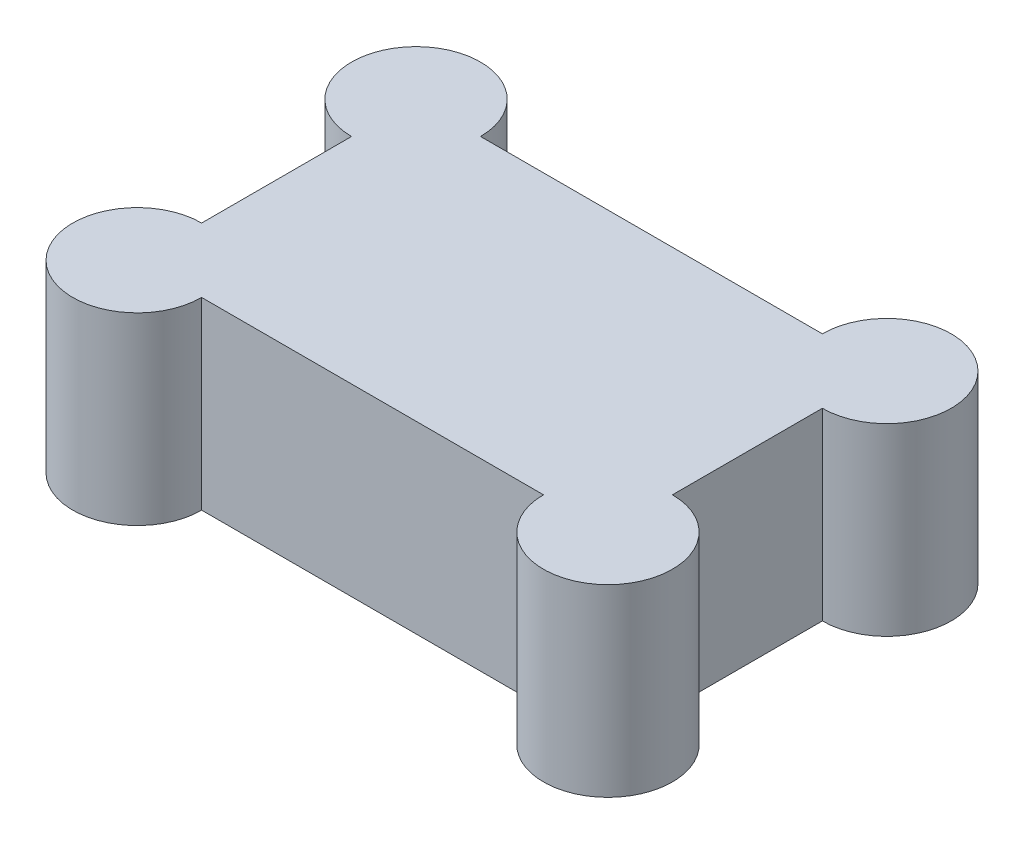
ISO-10303-21;
HEADER;
FILE_DESCRIPTION(('STEP AP214'),'2;1');
FILE_NAME('part.step','',(''),(''),'','','');
FILE_SCHEMA(('AUTOMOTIVE_DESIGN { 1 0 10303 214 1 1 1 1 }'));
ENDSEC;
DATA;
#1=APPLICATION_CONTEXT('core data for automotive mechanical design processes');
#2=APPLICATION_PROTOCOL_DEFINITION('international standard','automotive_design',2000,#1);
#3=PRODUCT_CONTEXT('',#1,'mechanical');
#4=PRODUCT('Part','Part','',(#3));
#5=PRODUCT_RELATED_PRODUCT_CATEGORY('part','',(#4));
#6=PRODUCT_DEFINITION_FORMATION('','',#4);
#7=PRODUCT_DEFINITION_CONTEXT('part definition',#1,'design');
#8=PRODUCT_DEFINITION('design','',#6,#7);
#9=PRODUCT_DEFINITION_SHAPE('','',#8);
#10=(LENGTH_UNIT() NAMED_UNIT(*) SI_UNIT(.MILLI.,.METRE.));
#11=(NAMED_UNIT(*) PLANE_ANGLE_UNIT() SI_UNIT($,.RADIAN.));
#12=(NAMED_UNIT(*) SI_UNIT($,.STERADIAN.) SOLID_ANGLE_UNIT());
#13=UNCERTAINTY_MEASURE_WITH_UNIT(LENGTH_MEASURE(1.E-05),#10,'distance_accuracy_value','');
#14=(GEOMETRIC_REPRESENTATION_CONTEXT(3) GLOBAL_UNCERTAINTY_ASSIGNED_CONTEXT((#13)) GLOBAL_UNIT_ASSIGNED_CONTEXT((#10,
#11,#12)) REPRESENTATION_CONTEXT('',''));
#15=CARTESIAN_POINT('',(0.,0.,0.));
#16=DIRECTION('',(0.,0.,1.));
#17=DIRECTION('',(1.,0.,0.));
#18=AXIS2_PLACEMENT_3D('',#15,#16,#17);
#19=CARTESIAN_POINT('',(-25.5535213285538,20.,-15.1362990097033));
#20=DIRECTION('',(0.,-1.,0.));
#21=DIRECTION('',(0.,0.,-1.));
#22=AXIS2_PLACEMENT_3D('',#19,#20,#21);
#23=CYLINDRICAL_SURFACE('',#22,7.);
#24=CARTESIAN_POINT('',(-25.5535213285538,0.,-15.1362990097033));
#25=DIRECTION('',(0.,1.,0.));
#26=DIRECTION('',(0.,0.,1.));
#27=AXIS2_PLACEMENT_3D('',#24,#25,#26);
#28=CIRCLE('',#27,7.);
#29=CARTESIAN_POINT('',(-18.5535213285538,0.,-15.1362990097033));
#30=VERTEX_POINT('',#29);
#31=CARTESIAN_POINT('',(-25.5535213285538,0.,-8.13629900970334));
#32=VERTEX_POINT('',#31);
#33=EDGE_CURVE('E131',#30,#32,#28,.T.);
#34=ORIENTED_EDGE('',*,*,#33,.T.);
#35=DIRECTION('',(0.,-1.,0.));
#36=VECTOR('',#35,1.);
#37=CARTESIAN_POINT('',(-25.5535213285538,20.,-8.13629900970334));
#38=LINE('',#37,#36);
#39=CARTESIAN_POINT('',(-25.5535213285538,20.,-8.13629900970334));
#40=VERTEX_POINT('',#39);
#41=EDGE_CURVE('E11',#40,#32,#38,.T.);
#42=ORIENTED_EDGE('',*,*,#41,.F.);
#43=CARTESIAN_POINT('',(-25.5535213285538,20.,-15.1362990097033));
#44=DIRECTION('',(0.,1.,0.));
#45=DIRECTION('',(0.,0.,1.));
#46=AXIS2_PLACEMENT_3D('',#43,#44,#45);
#47=CIRCLE('',#46,7.);
#48=CARTESIAN_POINT('',(-18.5535213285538,20.,-15.1362990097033));
#49=VERTEX_POINT('',#48);
#50=EDGE_CURVE('E148',#49,#40,#47,.T.);
#51=ORIENTED_EDGE('',*,*,#50,.F.);
#52=DIRECTION('',(0.,-1.,0.));
#53=VECTOR('',#52,1.);
#54=CARTESIAN_POINT('',(-18.5535213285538,20.,-15.1362990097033));
#55=LINE('',#54,#53);
#56=EDGE_CURVE('E49',#49,#30,#55,.T.);
#57=ORIENTED_EDGE('',*,*,#56,.T.);
#58=EDGE_LOOP('',(#34,#42,#51,#57));
#59=FACE_BOUND('',#58,.T.);
#60=ADVANCED_FACE('F33',(#59),#23,.T.);
#61=CARTESIAN_POINT('',(-25.5535213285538,20.,-8.13629900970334));
#62=DIRECTION('',(1.,0.,0.));
#63=DIRECTION('',(0.,0.,-1.));
#64=AXIS2_PLACEMENT_3D('',#61,#62,#63);
#65=PLANE('',#64);
#66=DIRECTION('',(0.,0.,1.));
#67=VECTOR('',#66,1.);
#68=CARTESIAN_POINT('',(-25.5535213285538,0.,-8.13629900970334));
#69=LINE('',#68,#67);
#70=CARTESIAN_POINT('',(-25.5535213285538,0.,8.13629900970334));
#71=VERTEX_POINT('',#70);
#72=EDGE_CURVE('E133',#32,#71,#69,.T.);
#73=ORIENTED_EDGE('',*,*,#72,.T.);
#74=DIRECTION('',(0.,-1.,0.));
#75=VECTOR('',#74,1.);
#76=CARTESIAN_POINT('',(-25.5535213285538,20.,8.13629900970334));
#77=LINE('',#76,#75);
#78=CARTESIAN_POINT('',(-25.5535213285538,20.,8.13629900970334));
#79=VERTEX_POINT('',#78);
#80=EDGE_CURVE('E41',#79,#71,#77,.T.);
#81=ORIENTED_EDGE('',*,*,#80,.F.);
#82=DIRECTION('',(0.,0.,1.));
#83=VECTOR('',#82,1.);
#84=CARTESIAN_POINT('',(-25.5535213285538,20.,-8.13629900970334));
#85=LINE('',#84,#83);
#86=EDGE_CURVE('E88',#40,#79,#85,.T.);
#87=ORIENTED_EDGE('',*,*,#86,.F.);
#88=ORIENTED_EDGE('',*,*,#41,.T.);
#89=EDGE_LOOP('',(#73,#81,#87,#88));
#90=FACE_BOUND('',#89,.T.);
#91=ADVANCED_FACE('F185',(#90),#65,.F.);
#92=CARTESIAN_POINT('',(-25.5535213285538,20.,15.1362990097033));
#93=DIRECTION('',(0.,-1.,0.));
#94=DIRECTION('',(0.,0.,-1.));
#95=AXIS2_PLACEMENT_3D('',#92,#93,#94);
#96=CYLINDRICAL_SURFACE('',#95,7.);
#97=CARTESIAN_POINT('',(-25.5535213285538,0.,15.1362990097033));
#98=DIRECTION('',(0.,1.,0.));
#99=DIRECTION('',(0.,0.,1.));
#100=AXIS2_PLACEMENT_3D('',#97,#98,#99);
#101=CIRCLE('',#100,7.);
#102=CARTESIAN_POINT('',(-18.5535213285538,0.,15.1362990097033));
#103=VERTEX_POINT('',#102);
#104=EDGE_CURVE('E135',#71,#103,#101,.T.);
#105=ORIENTED_EDGE('',*,*,#104,.T.);
#106=DIRECTION('',(0.,-1.,0.));
#107=VECTOR('',#106,1.);
#108=CARTESIAN_POINT('',(-18.5535213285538,20.,15.1362990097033));
#109=LINE('',#108,#107);
#110=CARTESIAN_POINT('',(-18.5535213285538,20.,15.1362990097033));
#111=VERTEX_POINT('',#110);
#112=EDGE_CURVE('E155',#111,#103,#109,.T.);
#113=ORIENTED_EDGE('',*,*,#112,.F.);
#114=CARTESIAN_POINT('',(-25.5535213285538,20.,15.1362990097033));
#115=DIRECTION('',(0.,1.,0.));
#116=DIRECTION('',(0.,0.,1.));
#117=AXIS2_PLACEMENT_3D('',#114,#115,#116);
#118=CIRCLE('',#117,7.);
#119=EDGE_CURVE('E163',#79,#111,#118,.T.);
#120=ORIENTED_EDGE('',*,*,#119,.F.);
#121=ORIENTED_EDGE('',*,*,#80,.T.);
#122=EDGE_LOOP('',(#105,#113,#120,#121));
#123=FACE_BOUND('',#122,.T.);
#124=ADVANCED_FACE('F161',(#123),#96,.T.);
#125=CARTESIAN_POINT('',(-18.5535213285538,20.,15.1362990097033));
#126=DIRECTION('',(0.,0.,-1.));
#127=DIRECTION('',(-1.,0.,0.));
#128=AXIS2_PLACEMENT_3D('',#125,#126,#127);
#129=PLANE('',#128);
#130=DIRECTION('',(1.,0.,0.));
#131=VECTOR('',#130,1.);
#132=CARTESIAN_POINT('',(-18.5535213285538,0.,15.1362990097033));
#133=LINE('',#132,#131);
#134=CARTESIAN_POINT('',(18.5535213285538,0.,15.1362990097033));
#135=VERTEX_POINT('',#134);
#136=EDGE_CURVE('E137',#103,#135,#133,.T.);
#137=ORIENTED_EDGE('',*,*,#136,.T.);
#138=DIRECTION('',(0.,-1.,0.));
#139=VECTOR('',#138,1.);
#140=CARTESIAN_POINT('',(18.5535213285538,20.,15.1362990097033));
#141=LINE('',#140,#139);
#142=CARTESIAN_POINT('',(18.5535213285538,20.,15.1362990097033));
#143=VERTEX_POINT('',#142);
#144=EDGE_CURVE('E152',#143,#135,#141,.T.);
#145=ORIENTED_EDGE('',*,*,#144,.F.);
#146=DIRECTION('',(1.,0.,0.));
#147=VECTOR('',#146,1.);
#148=CARTESIAN_POINT('',(-18.5535213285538,20.,15.1362990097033));
#149=LINE('',#148,#147);
#150=EDGE_CURVE('E126',#111,#143,#149,.T.);
#151=ORIENTED_EDGE('',*,*,#150,.F.);
#152=ORIENTED_EDGE('',*,*,#112,.T.);
#153=EDGE_LOOP('',(#137,#145,#151,#152));
#154=FACE_BOUND('',#153,.T.);
#155=ADVANCED_FACE('F170',(#154),#129,.F.);
#156=CARTESIAN_POINT('',(25.5535213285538,20.,15.1362990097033));
#157=DIRECTION('',(0.,-1.,0.));
#158=DIRECTION('',(0.,0.,-1.));
#159=AXIS2_PLACEMENT_3D('',#156,#157,#158);
#160=CYLINDRICAL_SURFACE('',#159,7.);
#161=CARTESIAN_POINT('',(25.5535213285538,0.,15.1362990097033));
#162=DIRECTION('',(0.,1.,0.));
#163=DIRECTION('',(0.,0.,1.));
#164=AXIS2_PLACEMENT_3D('',#161,#162,#163);
#165=CIRCLE('',#164,7.);
#166=CARTESIAN_POINT('',(25.5535213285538,0.,8.13629900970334));
#167=VERTEX_POINT('',#166);
#168=EDGE_CURVE('E139',#135,#167,#165,.T.);
#169=ORIENTED_EDGE('',*,*,#168,.T.);
#170=DIRECTION('',(0.,-1.,0.));
#171=VECTOR('',#170,1.);
#172=CARTESIAN_POINT('',(25.5535213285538,20.,8.13629900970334));
#173=LINE('',#172,#171);
#174=CARTESIAN_POINT('',(25.5535213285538,20.,8.13629900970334));
#175=VERTEX_POINT('',#174);
#176=EDGE_CURVE('E113',#175,#167,#173,.T.);
#177=ORIENTED_EDGE('',*,*,#176,.F.);
#178=CARTESIAN_POINT('',(25.5535213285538,20.,15.1362990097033));
#179=DIRECTION('',(0.,1.,0.));
#180=DIRECTION('',(0.,0.,1.));
#181=AXIS2_PLACEMENT_3D('',#178,#179,#180);
#182=CIRCLE('',#181,7.);
#183=EDGE_CURVE('E123',#143,#175,#182,.T.);
#184=ORIENTED_EDGE('',*,*,#183,.F.);
#185=ORIENTED_EDGE('',*,*,#144,.T.);
#186=EDGE_LOOP('',(#169,#177,#184,#185));
#187=FACE_BOUND('',#186,.T.);
#188=ADVANCED_FACE('F173',(#187),#160,.T.);
#189=CARTESIAN_POINT('',(25.5535213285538,20.,-8.13629900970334));
#190=DIRECTION('',(1.,0.,0.));
#191=DIRECTION('',(0.,0.,-1.));
#192=AXIS2_PLACEMENT_3D('',#189,#190,#191);
#193=PLANE('',#192);
#194=DIRECTION('',(0.,0.,1.));
#195=VECTOR('',#194,1.);
#196=CARTESIAN_POINT('',(25.5535213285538,0.,-8.13629900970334));
#197=LINE('',#196,#195);
#198=CARTESIAN_POINT('',(25.5535213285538,0.,-8.13629900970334));
#199=VERTEX_POINT('',#198);
#200=EDGE_CURVE('E110',#199,#167,#197,.T.);
#201=ORIENTED_EDGE('',*,*,#200,.F.);
#202=DIRECTION('',(0.,-1.,0.));
#203=VECTOR('',#202,1.);
#204=CARTESIAN_POINT('',(25.5535213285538,20.,-8.13629900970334));
#205=LINE('',#204,#203);
#206=CARTESIAN_POINT('',(25.5535213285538,20.,-8.13629900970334));
#207=VERTEX_POINT('',#206);
#208=EDGE_CURVE('E104',#207,#199,#205,.T.);
#209=ORIENTED_EDGE('',*,*,#208,.F.);
#210=DIRECTION('',(0.,0.,1.));
#211=VECTOR('',#210,1.);
#212=CARTESIAN_POINT('',(25.5535213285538,20.,-8.13629900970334));
#213=LINE('',#212,#211);
#214=EDGE_CURVE('E108',#207,#175,#213,.T.);
#215=ORIENTED_EDGE('',*,*,#214,.T.);
#216=ORIENTED_EDGE('',*,*,#176,.T.);
#217=EDGE_LOOP('',(#201,#209,#215,#216));
#218=FACE_BOUND('',#217,.T.);
#219=ADVANCED_FACE('F106',(#218),#193,.T.);
#220=CARTESIAN_POINT('',(25.5535213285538,20.,-15.1362990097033));
#221=DIRECTION('',(0.,-1.,0.));
#222=DIRECTION('',(0.,0.,-1.));
#223=AXIS2_PLACEMENT_3D('',#220,#221,#222);
#224=CYLINDRICAL_SURFACE('',#223,7.);
#225=CARTESIAN_POINT('',(25.5535213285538,0.,-15.1362990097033));
#226=DIRECTION('',(0.,1.,0.));
#227=DIRECTION('',(0.,0.,1.));
#228=AXIS2_PLACEMENT_3D('',#225,#226,#227);
#229=CIRCLE('',#228,7.);
#230=CARTESIAN_POINT('',(18.5535213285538,0.,-15.1362990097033));
#231=VERTEX_POINT('',#230);
#232=EDGE_CURVE('E143',#199,#231,#229,.T.);
#233=ORIENTED_EDGE('',*,*,#232,.T.);
#234=DIRECTION('',(0.,-1.,0.));
#235=VECTOR('',#234,1.);
#236=CARTESIAN_POINT('',(18.5535213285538,20.,-15.1362990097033));
#237=LINE('',#236,#235);
#238=CARTESIAN_POINT('',(18.5535213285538,20.,-15.1362990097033));
#239=VERTEX_POINT('',#238);
#240=EDGE_CURVE('E76',#239,#231,#237,.T.);
#241=ORIENTED_EDGE('',*,*,#240,.F.);
#242=CARTESIAN_POINT('',(25.5535213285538,20.,-15.1362990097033));
#243=DIRECTION('',(0.,1.,0.));
#244=DIRECTION('',(0.,0.,1.));
#245=AXIS2_PLACEMENT_3D('',#242,#243,#244);
#246=CIRCLE('',#245,7.);
#247=EDGE_CURVE('E115',#207,#239,#246,.T.);
#248=ORIENTED_EDGE('',*,*,#247,.F.);
#249=ORIENTED_EDGE('',*,*,#208,.T.);
#250=EDGE_LOOP('',(#233,#241,#248,#249));
#251=FACE_BOUND('',#250,.T.);
#252=ADVANCED_FACE('F116',(#251),#224,.T.);
#253=CARTESIAN_POINT('',(-18.5535213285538,20.,-15.1362990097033));
#254=DIRECTION('',(0.,0.,-1.));
#255=DIRECTION('',(-1.,0.,0.));
#256=AXIS2_PLACEMENT_3D('',#253,#254,#255);
#257=PLANE('',#256);
#258=DIRECTION('',(1.,0.,0.));
#259=VECTOR('',#258,1.);
#260=CARTESIAN_POINT('',(-18.5535213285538,0.,-15.1362990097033));
#261=LINE('',#260,#259);
#262=EDGE_CURVE('E145',#30,#231,#261,.T.);
#263=ORIENTED_EDGE('',*,*,#262,.F.);
#264=ORIENTED_EDGE('',*,*,#56,.F.);
#265=DIRECTION('',(1.,0.,0.));
#266=VECTOR('',#265,1.);
#267=CARTESIAN_POINT('',(-18.5535213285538,20.,-15.1362990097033));
#268=LINE('',#267,#266);
#269=EDGE_CURVE('E119',#49,#239,#268,.T.);
#270=ORIENTED_EDGE('',*,*,#269,.T.);
#271=ORIENTED_EDGE('',*,*,#240,.T.);
#272=EDGE_LOOP('',(#263,#264,#270,#271));
#273=FACE_BOUND('',#272,.T.);
#274=ADVANCED_FACE('F174',(#273),#257,.T.);
#275=CARTESIAN_POINT('',(-25.5535213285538,20.,-15.1362990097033));
#276=DIRECTION('',(0.,1.,0.));
#277=DIRECTION('',(0.,0.,1.));
#278=AXIS2_PLACEMENT_3D('',#275,#276,#277);
#279=PLANE('',#278);
#280=ORIENTED_EDGE('',*,*,#50,.T.);
#281=ORIENTED_EDGE('',*,*,#86,.T.);
#282=ORIENTED_EDGE('',*,*,#119,.T.);
#283=ORIENTED_EDGE('',*,*,#150,.T.);
#284=ORIENTED_EDGE('',*,*,#183,.T.);
#285=ORIENTED_EDGE('',*,*,#214,.F.);
#286=ORIENTED_EDGE('',*,*,#247,.T.);
#287=ORIENTED_EDGE('',*,*,#269,.F.);
#288=EDGE_LOOP('',(#280,#281,#282,#283,#284,#285,#286,#287));
#289=FACE_BOUND('',#288,.T.);
#290=ADVANCED_FACE('F121',(#289),#279,.T.);
#291=CARTESIAN_POINT('',(-25.5535213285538,0.,-15.1362990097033));
#292=DIRECTION('',(0.,1.,0.));
#293=DIRECTION('',(0.,0.,1.));
#294=AXIS2_PLACEMENT_3D('',#291,#292,#293);
#295=PLANE('',#294);
#296=ORIENTED_EDGE('',*,*,#33,.F.);
#297=ORIENTED_EDGE('',*,*,#262,.T.);
#298=ORIENTED_EDGE('',*,*,#232,.F.);
#299=ORIENTED_EDGE('',*,*,#200,.T.);
#300=ORIENTED_EDGE('',*,*,#168,.F.);
#301=ORIENTED_EDGE('',*,*,#136,.F.);
#302=ORIENTED_EDGE('',*,*,#104,.F.);
#303=ORIENTED_EDGE('',*,*,#72,.F.);
#304=EDGE_LOOP('',(#296,#297,#298,#299,#300,#301,#302,#303));
#305=FACE_BOUND('',#304,.T.);
#306=ADVANCED_FACE('F166',(#305),#295,.F.);
#307=CLOSED_SHELL('',(#60,#91,#124,#155,#188,#219,#252,#274,#290,#306));
#308=MANIFOLD_SOLID_BREP('B2',#307);
#309=ADVANCED_BREP_SHAPE_REPRESENTATION('',(#18,#308),#14);
#310=SHAPE_DEFINITION_REPRESENTATION(#9,#309);
ENDSEC;
END-ISO-10303-21;
